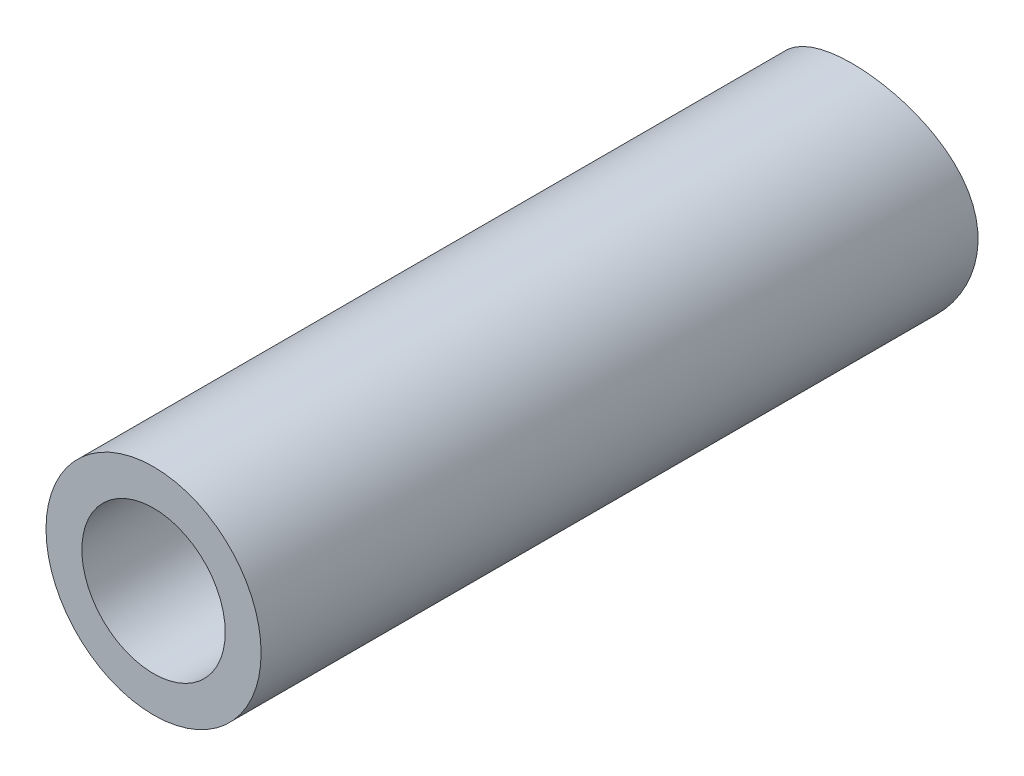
ISO-10303-21;
HEADER;
FILE_DESCRIPTION(('STEP AP214'),'2;1');
FILE_NAME('part.step','',(''),(''),'','','');
FILE_SCHEMA(('AUTOMOTIVE_DESIGN { 1 0 10303 214 1 1 1 1 }'));
ENDSEC;
DATA;
#1=APPLICATION_CONTEXT('core data for automotive mechanical design processes');
#2=APPLICATION_PROTOCOL_DEFINITION('international standard','automotive_design',2000,#1);
#3=PRODUCT_CONTEXT('',#1,'mechanical');
#4=PRODUCT('Part','Part','',(#3));
#5=PRODUCT_RELATED_PRODUCT_CATEGORY('part','',(#4));
#6=PRODUCT_DEFINITION_FORMATION('','',#4);
#7=PRODUCT_DEFINITION_CONTEXT('part definition',#1,'design');
#8=PRODUCT_DEFINITION('design','',#6,#7);
#9=PRODUCT_DEFINITION_SHAPE('','',#8);
#10=(LENGTH_UNIT() NAMED_UNIT(*) SI_UNIT(.MILLI.,.METRE.));
#11=(NAMED_UNIT(*) PLANE_ANGLE_UNIT() SI_UNIT($,.RADIAN.));
#12=(NAMED_UNIT(*) SI_UNIT($,.STERADIAN.) SOLID_ANGLE_UNIT());
#13=UNCERTAINTY_MEASURE_WITH_UNIT(LENGTH_MEASURE(1.E-05),#10,'distance_accuracy_value','');
#14=(GEOMETRIC_REPRESENTATION_CONTEXT(3) GLOBAL_UNCERTAINTY_ASSIGNED_CONTEXT((#13)) GLOBAL_UNIT_ASSIGNED_CONTEXT((#10,
#11,#12)) REPRESENTATION_CONTEXT('',''));
#15=CARTESIAN_POINT('',(0.,0.,0.));
#16=DIRECTION('',(0.,0.,1.));
#17=DIRECTION('',(1.,0.,0.));
#18=AXIS2_PLACEMENT_3D('',#15,#16,#17);
#19=CARTESIAN_POINT('',(0.,-25.,-21.2132034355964));
#20=DIRECTION('',(0.,1.,0.));
#21=DIRECTION('',(0.,0.,1.));
#22=AXIS2_PLACEMENT_3D('',#19,#20,#21);
#23=CYLINDRICAL_SURFACE('',#22,22.5);
#24=CARTESIAN_POINT('',(-7.49999999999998,0.,0.));
#25=CARTESIAN_POINT('',(-7.50000007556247,-0.204256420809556,-6.30016733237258E-08));
#26=CARTESIAN_POINT('',(-7.49164890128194,-0.408511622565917,0.00295809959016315));
#27=CARTESIAN_POINT('',(-7.45832835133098,-0.815490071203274,0.014694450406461));
#28=CARTESIAN_POINT('',(-7.43335909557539,-1.01821332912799,0.0234725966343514));
#29=CARTESIAN_POINT('',(-7.36704817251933,-1.42062752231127,0.0465667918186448));
#30=CARTESIAN_POINT('',(-7.32570748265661,-1.6203186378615,0.0608825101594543));
#31=CARTESIAN_POINT('',(-7.22702337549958,-2.01534149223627,0.0946084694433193));
#32=CARTESIAN_POINT('',(-7.16967371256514,-2.21067149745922,0.114020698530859));
#33=CARTESIAN_POINT('',(-7.03963001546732,-2.59512582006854,0.157297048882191));
#34=CARTESIAN_POINT('',(-6.96697297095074,-2.7842638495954,0.181150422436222));
#35=CARTESIAN_POINT('',(-6.8068225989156,-3.15564824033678,0.232640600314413));
#36=CARTESIAN_POINT('',(-6.71932367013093,-3.33789196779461,0.260278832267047));
#37=CARTESIAN_POINT('',(-6.43555945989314,-3.8724815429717,0.347706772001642));
#38=CARTESIAN_POINT('',(-6.21791880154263,-4.21300281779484,0.412047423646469));
#39=CARTESIAN_POINT('',(-5.72281205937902,-4.86549659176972,0.548398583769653));
#40=CARTESIAN_POINT('',(-5.44349560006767,-5.17602545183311,0.620600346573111));
#41=CARTESIAN_POINT('',(-4.98892443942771,-5.60393660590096,0.727284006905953));
#42=CARTESIAN_POINT('',(-4.83136290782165,-5.74033029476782,0.762596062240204));
#43=CARTESIAN_POINT('',(-4.50526321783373,-5.99966172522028,0.83175822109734));
#44=CARTESIAN_POINT('',(-4.33672919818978,-6.12260449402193,0.865608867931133));
#45=CARTESIAN_POINT('',(-3.9850785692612,-6.35728119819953,0.931818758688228));
#46=CARTESIAN_POINT('',(-3.80169354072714,-6.46863071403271,0.964114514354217));
#47=CARTESIAN_POINT('',(-3.42568190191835,-6.67538101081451,1.02529836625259));
#48=CARTESIAN_POINT('',(-3.23305875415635,-6.77078770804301,1.0541877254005));
#49=CARTESIAN_POINT('',(-2.83983590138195,-6.9448949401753,1.1077441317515));
#50=CARTESIAN_POINT('',(-2.63923628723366,-7.02359566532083,1.13241122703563));
#51=CARTESIAN_POINT('',(-2.23151626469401,-7.16357352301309,1.17680271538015));
#52=CARTESIAN_POINT('',(-2.02439613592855,-7.22485140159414,1.19652732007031));
#53=CARTESIAN_POINT('',(-1.61250717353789,-7.32757075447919,1.22985822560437));
#54=CARTESIAN_POINT('',(-1.40790710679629,-7.3696280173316,1.2436534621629));
#55=CARTESIAN_POINT('',(-0.995622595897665,-7.43655464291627,1.26570543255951));
#56=CARTESIAN_POINT('',(-0.787938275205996,-7.46142469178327,1.27396238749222));
#57=CARTESIAN_POINT('',(-0.371113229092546,-7.49372825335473,1.28470159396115));
#58=CARTESIAN_POINT('',(-0.161972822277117,-7.50116546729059,1.28718507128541));
#59=CARTESIAN_POINT('',(0.256183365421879,-7.49853867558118,1.28630943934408));
#60=CARTESIAN_POINT('',(0.465199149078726,-7.48847507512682,1.28295046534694));
#61=CARTESIAN_POINT('',(0.873266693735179,-7.45169148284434,1.2707335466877));
#62=CARTESIAN_POINT('',(1.07238620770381,-7.42564434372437,1.26209779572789));
#63=CARTESIAN_POINT('',(1.46768582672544,-7.35772584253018,1.23974962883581));
#64=CARTESIAN_POINT('',(1.6638649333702,-7.31584922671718,1.22603552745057));
#65=CARTESIAN_POINT('',(2.05181243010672,-7.21665715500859,1.19389236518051));
#66=CARTESIAN_POINT('',(2.24358222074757,-7.15934667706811,1.17546482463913));
#67=CARTESIAN_POINT('',(2.62159388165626,-7.02973579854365,1.1343559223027));
#68=CARTESIAN_POINT('',(2.80783363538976,-6.95742974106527,1.11167295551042));
#69=CARTESIAN_POINT('',(3.17588293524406,-6.79739277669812,1.06231413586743));
#70=CARTESIAN_POINT('',(3.3576056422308,-6.70947684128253,1.03559103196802));
#71=CARTESIAN_POINT('',(3.71306490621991,-6.51949205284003,0.979037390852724));
#72=CARTESIAN_POINT('',(3.88679870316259,-6.41741835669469,0.949205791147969));
#73=CARTESIAN_POINT('',(4.22521071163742,-6.19984375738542,0.887185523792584));
#74=CARTESIAN_POINT('',(4.38988841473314,-6.08434210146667,0.854996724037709));
#75=CARTESIAN_POINT('',(4.70924994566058,-5.84066025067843,0.789059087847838));
#76=CARTESIAN_POINT('',(4.86393340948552,-5.71247959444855,0.755310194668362));
#77=CARTESIAN_POINT('',(5.16950250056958,-5.43786809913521,0.685471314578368));
#78=CARTESIAN_POINT('',(5.31986252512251,-5.2908608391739,0.649346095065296));
#79=CARTESIAN_POINT('',(5.6076890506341,-4.98477133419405,0.577295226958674));
#80=CARTESIAN_POINT('',(5.74515957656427,-4.82569288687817,0.541369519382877));
#81=CARTESIAN_POINT('',(6.0064495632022,-4.49630703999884,0.470682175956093));
#82=CARTESIAN_POINT('',(6.13026180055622,-4.32599377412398,0.435921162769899));
#83=CARTESIAN_POINT('',(6.363260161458,-3.97532593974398,0.368585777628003));
#84=CARTESIAN_POINT('',(6.47245199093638,-3.7949753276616,0.336010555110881));
#85=CARTESIAN_POINT('',(6.67695867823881,-3.42257332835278,0.273532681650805));
#86=CARTESIAN_POINT('',(6.77204546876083,-3.2303887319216,0.243676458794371));
#87=CARTESIAN_POINT('',(6.94556657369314,-2.83814650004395,0.188137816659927));
#88=CARTESIAN_POINT('',(7.02400738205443,-2.63809197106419,0.162453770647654));
#89=CARTESIAN_POINT('',(7.16356375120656,-2.2314896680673,0.116090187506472));
#90=CARTESIAN_POINT('',(7.2246817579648,-2.02494281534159,0.0954099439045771));
#91=CARTESIAN_POINT('',(7.32900409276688,-1.60689255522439,0.0597546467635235));
#92=CARTESIAN_POINT('',(7.37220934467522,-1.39538940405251,0.0447792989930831));
#93=CARTESIAN_POINT('',(7.43872086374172,-0.978729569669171,0.0215937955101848));
#94=CARTESIAN_POINT('',(7.46283712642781,-0.773717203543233,0.0131088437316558));
#95=CARTESIAN_POINT('',(7.49408733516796,-0.362245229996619,0.00209606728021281));
#96=CARTESIAN_POINT('',(7.50122188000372,-0.155785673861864,-0.000431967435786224));
#97=CARTESIAN_POINT('',(7.49843684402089,0.25696948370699,0.000552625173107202));
#98=CARTESIAN_POINT('',(7.48851998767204,0.463265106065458,0.00406428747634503));
#99=CARTESIAN_POINT('',(7.45173846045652,0.874149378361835,0.0170102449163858));
#100=CARTESIAN_POINT('',(7.42487399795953,1.07873804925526,0.0264444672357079));
#101=CARTESIAN_POINT('',(7.35568537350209,1.47764907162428,0.0505022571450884));
#102=CARTESIAN_POINT('',(7.31392824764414,1.67208171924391,0.0649349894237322));
#103=CARTESIAN_POINT('',(7.21522329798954,2.056692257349,0.0986071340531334));
#104=CARTESIAN_POINT('',(7.1582704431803,2.24686871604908,0.117848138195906));
#105=CARTESIAN_POINT('',(7.02966868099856,2.62164064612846,0.160573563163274));
#106=CARTESIAN_POINT('',(6.95802306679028,2.80623735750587,0.184057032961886));
#107=CARTESIAN_POINT('',(6.80055174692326,3.16884583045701,0.234624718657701));
#108=CARTESIAN_POINT('',(6.71472065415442,3.34685505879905,0.261710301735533));
#109=CARTESIAN_POINT('',(6.52660085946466,3.70065817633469,0.319642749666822));
#110=CARTESIAN_POINT('',(6.42388053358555,3.87620762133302,0.350580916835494));
#111=CARTESIAN_POINT('',(6.20470288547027,4.21816578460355,0.414665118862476));
#112=CARTESIAN_POINT('',(6.08824082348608,4.3845713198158,0.447811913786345));
#113=CARTESIAN_POINT('',(5.8423462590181,4.70724323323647,0.515423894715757));
#114=CARTESIAN_POINT('',(5.71291258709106,4.86350869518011,0.549889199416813));
#115=CARTESIAN_POINT('',(5.44186679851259,5.16499552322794,0.619241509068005));
#116=CARTESIAN_POINT('',(5.30025439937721,5.31021663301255,0.65412852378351));
#117=CARTESIAN_POINT('',(4.9985428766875,5.59550986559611,0.725112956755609));
#118=CARTESIAN_POINT('',(4.83788089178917,5.7349932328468,0.76118730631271));
#119=CARTESIAN_POINT('',(4.50513974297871,5.99991049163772,0.831810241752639));
#120=CARTESIAN_POINT('',(4.33306441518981,6.12534906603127,0.866359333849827));
#121=CARTESIAN_POINT('',(3.97846498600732,6.36138305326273,0.933000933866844));
#122=CARTESIAN_POINT('',(3.79593694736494,6.47197281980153,0.965092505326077));
#123=CARTESIAN_POINT('',(3.42175802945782,6.67735717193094,1.02589450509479));
#124=CARTESIAN_POINT('',(3.23011101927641,6.77215838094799,1.05460634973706));
#125=CARTESIAN_POINT('',(2.84014037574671,6.94469438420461,1.10768545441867));
#126=CARTESIAN_POINT('',(2.64186549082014,7.02253132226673,1.13207854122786));
#127=CARTESIAN_POINT('',(2.23900604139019,7.16115977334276,1.17603250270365));
#128=CARTESIAN_POINT('',(2.03442403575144,7.22195810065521,1.19559530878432));
#129=CARTESIAN_POINT('',(1.62041862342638,7.32596701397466,1.22933141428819));
#130=CARTESIAN_POINT('',(1.4109956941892,7.36917932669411,1.24350524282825));
#131=CARTESIAN_POINT('',(0.9889215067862,7.43758930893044,1.26604673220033));
#132=CARTESIAN_POINT('',(0.776270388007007,7.4627877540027,1.27441464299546));
#133=CARTESIAN_POINT('',(0.35949082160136,7.49415536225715,1.28484449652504));
#134=CARTESIAN_POINT('',(0.155432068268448,7.50116398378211,1.28718458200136));
#135=CARTESIAN_POINT('',(-0.252564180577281,7.49852152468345,1.28630371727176));
#136=CARTESIAN_POINT('',(-0.456501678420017,7.48887077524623,1.28308287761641));
#137=CARTESIAN_POINT('',(-0.862732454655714,7.45300398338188,1.27116855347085));
#138=CARTESIAN_POINT('',(-1.06502587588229,7.42678939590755,1.26247554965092));
#139=CARTESIAN_POINT('',(-1.46652140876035,7.35804297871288,1.23985302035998));
#140=CARTESIAN_POINT('',(-1.66572351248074,7.31551110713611,1.22592348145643));
#141=CARTESIAN_POINT('',(-2.05645724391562,7.21533129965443,1.19346521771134));
#142=CARTESIAN_POINT('',(-2.24806074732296,7.15793797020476,1.17501421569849));
#143=CARTESIAN_POINT('',(-2.625731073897,7.02818740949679,1.13386871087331));
#144=CARTESIAN_POINT('',(-2.8117960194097,6.95582516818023,1.11117278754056));
#145=CARTESIAN_POINT('',(-3.17712290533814,6.79673277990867,1.0621159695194));
#146=CARTESIAN_POINT('',(-3.35638631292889,6.71000575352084,1.03575587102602));
#147=CARTESIAN_POINT('',(-3.70715503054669,6.52277111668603,0.980006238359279));
#148=CARTESIAN_POINT('',(-3.87865737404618,6.42225829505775,0.950615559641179));
#149=CARTESIAN_POINT('',(-4.2189791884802,6.20423507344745,0.88840788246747));
#150=CARTESIAN_POINT('',(-4.38747074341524,6.08623721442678,0.855504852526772));
#151=CARTESIAN_POINT('',(-4.71405146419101,5.83694581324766,0.788058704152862));
#152=CARTESIAN_POINT('',(-4.87213698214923,5.70564764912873,0.753515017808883));
#153=CARTESIAN_POINT('',(-5.17693972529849,5.43060204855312,0.683685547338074));
#154=CARTESIAN_POINT('',(-5.32365549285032,5.28685302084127,0.648399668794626));
#155=CARTESIAN_POINT('',(-5.60482903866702,4.98778691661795,0.578008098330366));
#156=CARTESIAN_POINT('',(-5.73928666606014,4.83246969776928,0.542902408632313));
#157=CARTESIAN_POINT('',(-6.00016554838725,4.50483863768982,0.472436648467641));
#158=CARTESIAN_POINT('',(-6.12606122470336,4.33209618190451,0.437121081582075));
#159=CARTESIAN_POINT('',(-6.36279004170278,3.97624866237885,0.368735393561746));
#160=CARTESIAN_POINT('',(-6.4736285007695,3.79314729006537,0.335664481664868));
#161=CARTESIAN_POINT('',(-6.6794746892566,3.41766934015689,0.272750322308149));
#162=CARTESIAN_POINT('',(-6.7744794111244,3.22529100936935,0.242907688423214));
#163=CARTESIAN_POINT('',(-6.94780470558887,2.83267223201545,0.187410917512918));
#164=CARTESIAN_POINT('',(-7.02613279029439,2.6324353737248,0.161754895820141));
#165=CARTESIAN_POINT('',(-7.16232361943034,2.23457576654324,0.116495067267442));
#166=CARTESIAN_POINT('',(-7.22094616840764,2.03723797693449,0.0966715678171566));
#167=CARTESIAN_POINT('',(-7.32182465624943,1.63806020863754,0.0622220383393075));
#168=CARTESIAN_POINT('',(-7.36408760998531,1.43622219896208,0.0475937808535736));
#169=CARTESIAN_POINT('',(-7.43187430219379,1.02944426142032,0.0239935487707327));
#170=CARTESIAN_POINT('',(-7.45739962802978,0.824504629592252,0.0150210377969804));
#171=CARTESIAN_POINT('',(-7.49146240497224,0.413042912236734,0.00302430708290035));
#172=CARTESIAN_POINT('',(-7.4999999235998,0.206520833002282,6.3700117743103E-08));
#173=CARTESIAN_POINT('',(-7.49999999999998,0.,0.));
#174=B_SPLINE_CURVE_WITH_KNOTS('',3,(#24,#25,#26,#27,#28,#29,#30,#31,#32,#33,#34,#35,#36,#37,
#38,#39,#40,#41,#42,#43,#44,#45,#46,#47,#48,#49,#50,#51,#52,#53,#54,#55,#56,#57,#58,#59,#60,#61,
#62,#63,#64,#65,#66,#67,#68,#69,#70,#71,#72,#73,#74,#75,#76,#77,#78,#79,#80,#81,#82,#83,#84,#85,
#86,#87,#88,#89,#90,#91,#92,#93,#94,#95,#96,#97,#98,#99,#100,#101,#102,#103,#104,#105,#106,#107,
#108,#109,#110,#111,#112,#113,#114,#115,#116,#117,#118,#119,#120,#121,#122,#123,#124,#125,#126,
#127,#128,#129,#130,#131,#132,#133,#134,#135,#136,#137,#138,#139,#140,#141,#142,#143,#144,#145,
#146,#147,#148,#149,#150,#151,#152,#153,#154,#155,#156,#157,#158,#159,#160,#161,#162,#163,#164,
#165,#166,#167,#168,#169,#170,#171,#172,#173),.UNSPECIFIED.,.T.,.F.,(4,2,2,2,2,2,2,2,2,2,2,2,2,
2,2,2,2,2,2,2,2,2,2,2,2,2,2,2,2,2,2,2,2,2,2,2,2,2,2,2,2,2,2,2,2,2,2,2,2,2,2,2,2,2,2,2,2,2,2,2,2,
2,2,2,2,2,2,2,2,2,2,2,2,2,4),(0.,0.612576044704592,1.22514766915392,1.8376827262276,
2.45045708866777,3.06176735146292,3.67330883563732,4.89539287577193,6.16088443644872,
6.7943896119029,7.4276572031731,8.07774384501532,8.72758870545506,9.37742616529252,
10.0272357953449,10.6544449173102,11.2816289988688,11.9086799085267,12.5357163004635,
13.1380126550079,13.7405090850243,14.3428114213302,14.9453413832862,15.5555587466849,
16.1659853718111,16.7764462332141,17.3869293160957,18.0262847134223,18.6654397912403,
19.3049312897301,19.9441724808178,20.5928284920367,21.2412309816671,21.8895418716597,
22.5378193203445,23.1568419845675,23.7758428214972,24.3947447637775,25.0136390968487,
25.6111207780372,26.2088005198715,26.8063464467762,27.4041198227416,28.0206352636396,
28.6373639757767,29.2541483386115,29.8709470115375,30.517578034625,31.1639928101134,
31.8106526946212,32.4570406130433,33.099421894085,33.7415458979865,34.3836068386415,
35.0256401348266,35.6374691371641,36.2492859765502,36.8610490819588,37.4728137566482,
38.0747211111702,38.6768302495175,39.2788087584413,39.8810154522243,40.5052623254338,
41.1297268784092,41.7542713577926,42.3788235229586,43.0279903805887,43.6769273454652,
44.3259874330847,44.9747545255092,45.5944488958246,46.2138772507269,46.8332468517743,
47.4526139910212),.UNSPECIFIED.);
#175=CARTESIAN_POINT('',(-7.49999999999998,0.,0.));
#176=VERTEX_POINT('',#175);
#177=EDGE_CURVE('E43',#176,#176,#174,.T.);
#178=ORIENTED_EDGE('',*,*,#177,.F.);
#179=EDGE_LOOP('',(#178));
#180=FACE_BOUND('',#179,.T.);
#181=CARTESIAN_POINT('',(-2.,0.,1.19773139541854));
#182=CARTESIAN_POINT('',(-1.99999511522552,0.112102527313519,1.19773257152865));
#183=CARTESIAN_POINT('',(-1.9905430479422,0.22428068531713,1.19858158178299));
#184=CARTESIAN_POINT('',(-1.95297721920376,0.445531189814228,1.20188571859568));
#185=CARTESIAN_POINT('',(-1.92484249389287,0.55459990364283,1.20434264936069));
#186=CARTESIAN_POINT('',(-1.85073322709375,0.766395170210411,1.21058217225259));
#187=CARTESIAN_POINT('',(-1.80476901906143,0.869125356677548,1.21436399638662));
#188=CARTESIAN_POINT('',(-1.69632439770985,1.06538876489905,1.22282623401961));
#189=CARTESIAN_POINT('',(-1.63384743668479,1.15892390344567,1.22750645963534));
#190=CARTESIAN_POINT('',(-1.49395532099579,1.33443727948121,1.23725339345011));
#191=CARTESIAN_POINT('',(-1.4165021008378,1.41638512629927,1.24232106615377));
#192=CARTESIAN_POINT('',(-1.24893692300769,1.56613642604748,1.25226308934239));
#193=CARTESIAN_POINT('',(-1.15882440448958,1.63393925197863,1.25713743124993));
#194=CARTESIAN_POINT('',(-0.968315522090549,1.75357838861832,1.26615286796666));
#195=CARTESIAN_POINT('',(-0.867902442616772,1.80538818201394,1.27029274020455));
#196=CARTESIAN_POINT('',(-0.659759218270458,1.89140094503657,1.27736235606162));
#197=CARTESIAN_POINT('',(-0.552029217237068,1.92560426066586,1.28029212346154));
#198=CARTESIAN_POINT('',(-0.332614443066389,1.97534507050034,1.28460467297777));
#199=CARTESIAN_POINT('',(-0.220940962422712,1.99093201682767,1.28599155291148));
#200=CARTESIAN_POINT('',(0.00344509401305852,2.00315054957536,1.28707596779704));
#201=CARTESIAN_POINT('',(0.116157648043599,1.99978253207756,1.28677353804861));
#202=CARTESIAN_POINT('',(0.339086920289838,1.97422709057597,1.2845167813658));
#203=CARTESIAN_POINT('',(0.449309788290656,1.9520928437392,1.28256712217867));
#204=CARTESIAN_POINT('',(0.664469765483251,1.88971598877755,1.27724050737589));
#205=CARTESIAN_POINT('',(0.769406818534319,1.84947318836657,1.27386353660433));
#206=CARTESIAN_POINT('',(0.971185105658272,1.75196260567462,1.26605410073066));
#207=CARTESIAN_POINT('',(1.06801481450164,1.69467109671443,1.26162016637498));
#208=CARTESIAN_POINT('',(1.25070399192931,1.56470661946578,1.25219484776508));
#209=CARTESIAN_POINT('',(1.33656320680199,1.49203329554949,1.24720345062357));
#210=CARTESIAN_POINT('',(1.49518526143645,1.33306860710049,1.23720352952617));
#211=CARTESIAN_POINT('',(1.56790178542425,1.24673101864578,1.23219500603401));
#212=CARTESIAN_POINT('',(1.6978162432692,1.06304943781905,1.2227426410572));
#213=CARTESIAN_POINT('',(1.75501416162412,0.965705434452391,1.21829880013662));
#214=CARTESIAN_POINT('',(1.85226648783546,0.76274077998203,1.21047826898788));
#215=CARTESIAN_POINT('',(1.8923183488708,0.657118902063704,1.20710173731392));
#216=CARTESIAN_POINT('',(1.95410660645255,0.440612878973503,1.20180130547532));
#217=CARTESIAN_POINT('',(1.97584344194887,0.329728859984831,1.19987737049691));
#218=CARTESIAN_POINT('',(2.00032569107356,0.106251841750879,1.19770575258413));
#219=CARTESIAN_POINT('',(2.00313575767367,-0.00633402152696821,1.19745236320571));
#220=CARTESIAN_POINT('',(1.98985419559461,-0.23037515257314,1.19863546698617));
#221=CARTESIAN_POINT('',(1.97376276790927,-0.341830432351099,1.20007194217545));
#222=CARTESIAN_POINT('',(1.92318895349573,-0.560260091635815,1.20446772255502));
#223=CARTESIAN_POINT('',(1.88873686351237,-0.667241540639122,1.20742451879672));
#224=CARTESIAN_POINT('',(1.80245053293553,-0.873905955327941,1.21452572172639));
#225=CARTESIAN_POINT('',(1.75061597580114,-0.97358878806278,1.21867015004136));
#226=CARTESIAN_POINT('',(1.63087301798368,-1.16312183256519,1.22769347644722));
#227=CARTESIAN_POINT('',(1.56292160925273,-1.25294477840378,1.23257432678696));
#228=CARTESIAN_POINT('',(1.41293580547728,-1.41993244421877,1.24251401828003));
#229=CARTESIAN_POINT('',(1.33090113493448,-1.49709691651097,1.24757286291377));
#230=CARTESIAN_POINT('',(1.15479774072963,-1.6367986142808,1.2573156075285));
#231=CARTESIAN_POINT('',(1.06069558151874,-1.69929377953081,1.26199840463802));
#232=CARTESIAN_POINT('',(0.863294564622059,-1.80759400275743,1.27044548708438));
#233=CARTESIAN_POINT('',(0.759995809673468,-1.8533992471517,1.27420978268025));
#234=CARTESIAN_POINT('',(0.547283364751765,-1.92694745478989,1.28039068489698));
#235=CARTESIAN_POINT('',(0.437878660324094,-1.95471623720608,1.28280921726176));
#236=CARTESIAN_POINT('',(0.215937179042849,-1.99148761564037,1.28603393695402));
#237=CARTESIAN_POINT('',(0.1034004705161,-2.00049062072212,1.28684015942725));
#238=CARTESIAN_POINT('',(-0.121196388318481,-1.99946981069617,1.28674945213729));
#239=CARTESIAN_POINT('',(-0.233256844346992,-1.98951146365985,1.28585838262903));
#240=CARTESIAN_POINT('',(-0.454106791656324,-1.9509873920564,1.28248478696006));
#241=CARTESIAN_POINT('',(-0.562896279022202,-1.92242164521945,1.28000225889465));
#242=CARTESIAN_POINT('',(-0.774118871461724,-1.84751077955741,1.27372415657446));
#243=CARTESIAN_POINT('',(-0.876552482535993,-1.80116707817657,1.26992868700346));
#244=CARTESIAN_POINT('',(-1.07219640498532,-1.69202312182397,1.26144883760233));
#245=CARTESIAN_POINT('',(-1.16540683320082,-1.62922307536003,1.25676446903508));
#246=CARTESIAN_POINT('',(-1.34029380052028,-1.48870323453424,1.24701299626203));
#247=CARTESIAN_POINT('',(-1.42193123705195,-1.41093485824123,1.24194467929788));
#248=CARTESIAN_POINT('',(-1.57102947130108,-1.2427769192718,1.23200686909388));
#249=CARTESIAN_POINT('',(-1.6384868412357,-1.15238431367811,1.22713742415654));
#250=CARTESIAN_POINT('',(-1.7574149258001,-0.96134491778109,1.21813776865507));
#251=CARTESIAN_POINT('',(-1.80885209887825,-0.860677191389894,1.21400911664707));
#252=CARTESIAN_POINT('',(-1.89402655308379,-0.652164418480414,1.20697735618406));
#253=CARTESIAN_POINT('',(-1.92778406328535,-0.544327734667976,1.20407284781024));
#254=CARTESIAN_POINT('',(-1.96809934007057,-0.363218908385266,1.20056069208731));
#255=CARTESIAN_POINT('',(-1.9800460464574,-0.291109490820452,1.19950462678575));
#256=CARTESIAN_POINT('',(-1.99599795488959,-0.146010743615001,1.19808959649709));
#257=CARTESIAN_POINT('',(-2.00000318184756,-0.0730214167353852,1.19773062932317));
#258=CARTESIAN_POINT('',(-2.,0.,1.19773139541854));
#259=B_SPLINE_CURVE_WITH_KNOTS('',3,(#181,#182,#183,#184,#185,#186,#187,#188,#189,#190,#191,
#192,#193,#194,#195,#196,#197,#198,#199,#200,#201,#202,#203,#204,#205,#206,#207,#208,#209,#210,
#211,#212,#213,#214,#215,#216,#217,#218,#219,#220,#221,#222,#223,#224,#225,#226,#227,#228,#229,
#230,#231,#232,#233,#234,#235,#236,#237,#238,#239,#240,#241,#242,#243,#244,#245,#246,#247,#248,
#249,#250,#251,#252,#253,#254,#255,#256,#257,#258),.UNSPECIFIED.,.T.,.F.,(4,2,2,2,2,2,2,2,2,2,2,
2,2,2,2,2,2,2,2,2,2,2,2,2,2,2,2,2,2,2,2,2,2,2,2,2,2,2,4),(0.,0.336040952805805,
0.672459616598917,1.00868359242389,1.34483732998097,1.68185698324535,2.018891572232,
2.35648201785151,2.69406582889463,3.03075088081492,3.36742889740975,3.70315605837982,
4.03888678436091,4.37508694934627,4.71129488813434,5.04866547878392,5.38603640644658,
5.72345742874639,6.060870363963,6.39713012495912,6.73338631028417,7.06908935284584,
7.40479850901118,7.74141379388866,8.07803566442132,8.41561122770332,8.75318302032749,
9.09027050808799,9.42735064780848,9.76326905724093,10.0991878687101,10.4350799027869,
10.7709676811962,11.10796459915,11.4450428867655,11.7828222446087,12.1202142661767,
12.3391055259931,12.557996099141),.UNSPECIFIED.);
#260=CARTESIAN_POINT('',(-2.,0.,1.19773139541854));
#261=VERTEX_POINT('',#260);
#262=EDGE_CURVE('E35',#261,#261,#259,.T.);
#263=ORIENTED_EDGE('',*,*,#262,.F.);
#264=EDGE_LOOP('',(#263));
#265=FACE_BOUND('',#264,.T.);
#266=ADVANCED_FACE('F30',(#180,#265),#23,.F.);
#267=CARTESIAN_POINT('',(0.,0.,50.));
#268=DIRECTION('',(0.,0.,-1.));
#269=DIRECTION('',(-1.,0.,0.));
#270=AXIS2_PLACEMENT_3D('',#267,#268,#269);
#271=CYLINDRICAL_SURFACE('',#270,7.5);
#272=CARTESIAN_POINT('',(0.,0.,50.));
#273=DIRECTION('',(0.,0.,1.));
#274=DIRECTION('',(1.,0.,0.));
#275=AXIS2_PLACEMENT_3D('',#272,#273,#274);
#276=CIRCLE('',#275,7.5);
#277=CARTESIAN_POINT('',(7.5,0.,50.));
#278=VERTEX_POINT('',#277);
#279=EDGE_CURVE('E10',#278,#278,#276,.T.);
#280=ORIENTED_EDGE('',*,*,#279,.F.);
#281=EDGE_LOOP('',(#280));
#282=FACE_BOUND('',#281,.T.);
#283=ORIENTED_EDGE('',*,*,#177,.T.);
#284=EDGE_LOOP('',(#283));
#285=FACE_BOUND('',#284,.T.);
#286=ADVANCED_FACE('F32',(#282,#285),#271,.T.);
#287=CARTESIAN_POINT('',(0.,0.,50.));
#288=DIRECTION('',(0.,0.,1.));
#289=DIRECTION('',(1.,0.,0.));
#290=AXIS2_PLACEMENT_3D('',#287,#288,#289);
#291=PLANE('',#290);
#292=CARTESIAN_POINT('',(0.,0.,50.));
#293=DIRECTION('',(0.,0.,1.));
#294=DIRECTION('',(1.,0.,0.));
#295=AXIS2_PLACEMENT_3D('',#292,#293,#294);
#296=CIRCLE('',#295,5.);
#297=CARTESIAN_POINT('',(5.,0.,50.));
#298=VERTEX_POINT('',#297);
#299=EDGE_CURVE('E72',#298,#298,#296,.T.);
#300=ORIENTED_EDGE('',*,*,#299,.F.);
#301=EDGE_LOOP('',(#300));
#302=FACE_BOUND('',#301,.T.);
#303=ORIENTED_EDGE('',*,*,#279,.T.);
#304=EDGE_LOOP('',(#303));
#305=FACE_BOUND('',#304,.T.);
#306=ADVANCED_FACE('F59',(#302,#305),#291,.T.);
#307=CARTESIAN_POINT('',(0.,0.,20.));
#308=DIRECTION('',(0.,0.,1.));
#309=DIRECTION('',(1.,0.,0.));
#310=AXIS2_PLACEMENT_3D('',#307,#308,#309);
#311=CYLINDRICAL_SURFACE('',#310,5.);
#312=CARTESIAN_POINT('',(0.,0.,20.));
#313=DIRECTION('',(0.,0.,1.));
#314=DIRECTION('',(1.,0.,0.));
#315=AXIS2_PLACEMENT_3D('',#312,#313,#314);
#316=CIRCLE('',#315,5.);
#317=CARTESIAN_POINT('',(5.,0.,20.));
#318=VERTEX_POINT('',#317);
#319=EDGE_CURVE('E47',#318,#318,#316,.T.);
#320=ORIENTED_EDGE('',*,*,#319,.F.);
#321=EDGE_LOOP('',(#320));
#322=FACE_BOUND('',#321,.T.);
#323=ORIENTED_EDGE('',*,*,#299,.T.);
#324=EDGE_LOOP('',(#323));
#325=FACE_BOUND('',#324,.T.);
#326=ADVANCED_FACE('F57',(#322,#325),#311,.F.);
#327=CARTESIAN_POINT('',(0.,0.,20.));
#328=DIRECTION('',(0.,0.,1.));
#329=DIRECTION('',(1.,0.,0.));
#330=AXIS2_PLACEMENT_3D('',#327,#328,#329);
#331=PLANE('',#330);
#332=ORIENTED_EDGE('',*,*,#319,.T.);
#333=EDGE_LOOP('',(#332));
#334=FACE_BOUND('',#333,.T.);
#335=ADVANCED_FACE('F67',(#334),#331,.T.);
#336=CARTESIAN_POINT('',(0.,0.,10.));
#337=DIRECTION('',(0.,0.,-1.));
#338=DIRECTION('',(-1.,0.,0.));
#339=AXIS2_PLACEMENT_3D('',#336,#337,#338);
#340=CYLINDRICAL_SURFACE('',#339,2.);
#341=CARTESIAN_POINT('',(0.,0.,10.));
#342=DIRECTION('',(0.,0.,1.));
#343=DIRECTION('',(1.,0.,0.));
#344=AXIS2_PLACEMENT_3D('',#341,#342,#343);
#345=CIRCLE('',#344,2.);
#346=CARTESIAN_POINT('',(2.,0.,10.));
#347=VERTEX_POINT('',#346);
#348=EDGE_CURVE('E76',#347,#347,#345,.T.);
#349=ORIENTED_EDGE('',*,*,#348,.T.);
#350=EDGE_LOOP('',(#349));
#351=FACE_BOUND('',#350,.T.);
#352=ORIENTED_EDGE('',*,*,#262,.T.);
#353=EDGE_LOOP('',(#352));
#354=FACE_BOUND('',#353,.T.);
#355=ADVANCED_FACE('F81',(#351,#354),#340,.F.);
#356=CARTESIAN_POINT('',(0.,0.,10.));
#357=DIRECTION('',(0.,0.,1.));
#358=DIRECTION('',(1.,0.,0.));
#359=AXIS2_PLACEMENT_3D('',#356,#357,#358);
#360=PLANE('',#359);
#361=ORIENTED_EDGE('',*,*,#348,.F.);
#362=EDGE_LOOP('',(#361));
#363=FACE_BOUND('',#362,.T.);
#364=ADVANCED_FACE('F84',(#363),#360,.F.);
#365=CLOSED_SHELL('',(#266,#286,#306,#326,#335,#355,#364));
#366=MANIFOLD_SOLID_BREP('B2',#365);
#367=ADVANCED_BREP_SHAPE_REPRESENTATION('',(#18,#366),#14);
#368=SHAPE_DEFINITION_REPRESENTATION(#9,#367);
ENDSEC;
END-ISO-10303-21;
